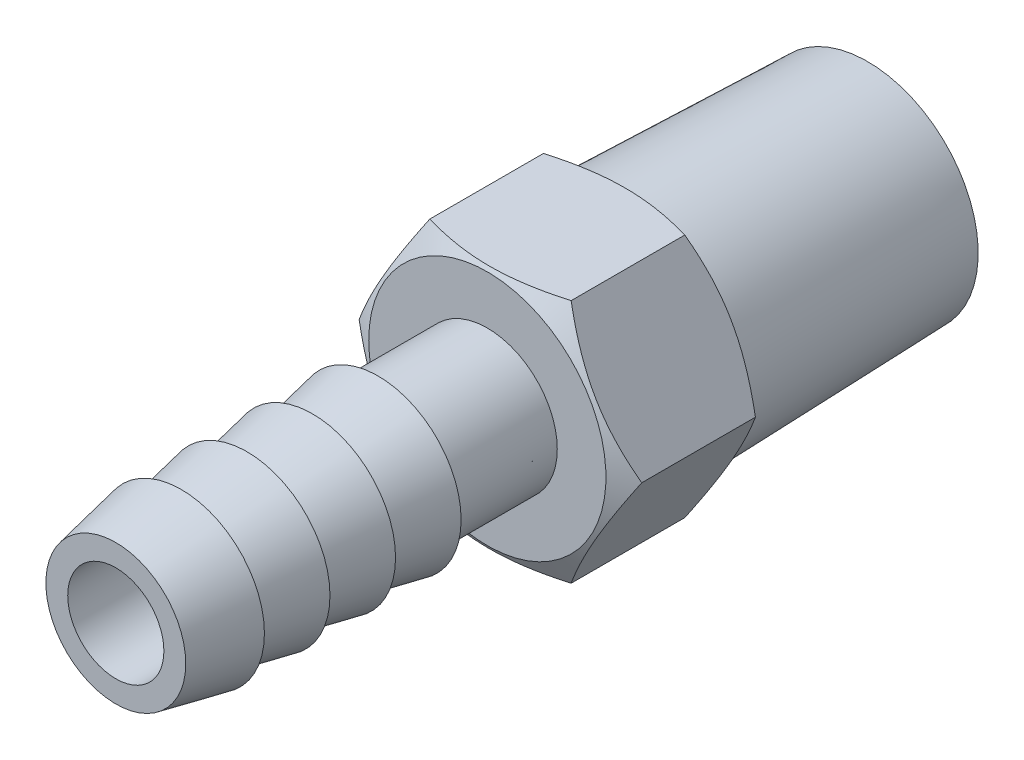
from build123d import *

# Parameters (mm, degrees)
BASE_EXTRUDE_DEPTH = 8.128
SKETCH4_R          = 2.794
CUT_EXTRUDE1_DEPTH = 25.624030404


with BuildPart() as part:
    # Sketch1 → Base-Extrude (new body)
    with BuildSketch(Plane.XY):
        Polygon((8.212230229, 0), (4.106115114, 7.112), (-4.106115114, 7.112), (-8.212230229, 0), (-4.106115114, -7.112), (4.106115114, -7.112), align=None)
    extrude(amount=BASE_EXTRUDE_DEPTH)

    # Sketch2 → Cut-Revolve1 (revolve, cut)
    with BuildSketch(Plane(origin=(0, 0, 0), x_dir=(1, 0, 0), z_dir=(0, 1, 0))):
        Polygon((6.112711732, -8.578157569), (8.212230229, -7.366), (8.212230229, -0.762), (6.112711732, 0.450157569), (11.192711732, 0.450157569), (11.192711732, -8.578157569), align=None)
    revolve(axis=Axis((0, 0, 0), (0, 0, 1)), mode=Mode.SUBTRACT)

    # Sketch3 → Boss-Revolve1 (revolve)
    with BuildSketch(Plane(origin=(0, 0, 0), x_dir=(1, 0, 0), z_dir=(0, 1, 0))):
        Polygon((6.858, 0), (2.794, 0), (2.794, 13.97), (6.423856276, 13.97), align=None)
    revolve(axis=Axis((0, 0, 0), (0, 0, 1)))

    # Sketch4 → Cut-Extrude1 (cut, through all)
    with BuildSketch(Plane.XY.offset(8.128)):
        with Locations(Location((0, 0, 0), (0, 0, 180))):
            Circle(SKETCH4_R)
    extrude(amount=-CUT_EXTRUDE1_DEPTH, mode=Mode.SUBTRACT)

    # Sketch5 → Boss-Revolve2 (revolve)
    with BuildSketch(Plane(origin=(0, 0, 0), x_dir=(1, 0, 0), z_dir=(0, 1, 0))):
        Polygon((2.794, -29.718), (4.064, -29.718), (4.826, -25.908), (4.064, -25.908), (4.826, -22.098), (4.064, -22.098), (4.826, -18.288), (4.064, -18.288), (4.826, -14.478), (4.064, -14.478), (4.064, -8.128), (2.794, -8.128), align=None)
    revolve(axis=Axis((0, 0, 0), (0, 0, -1)))


solid = part.part
